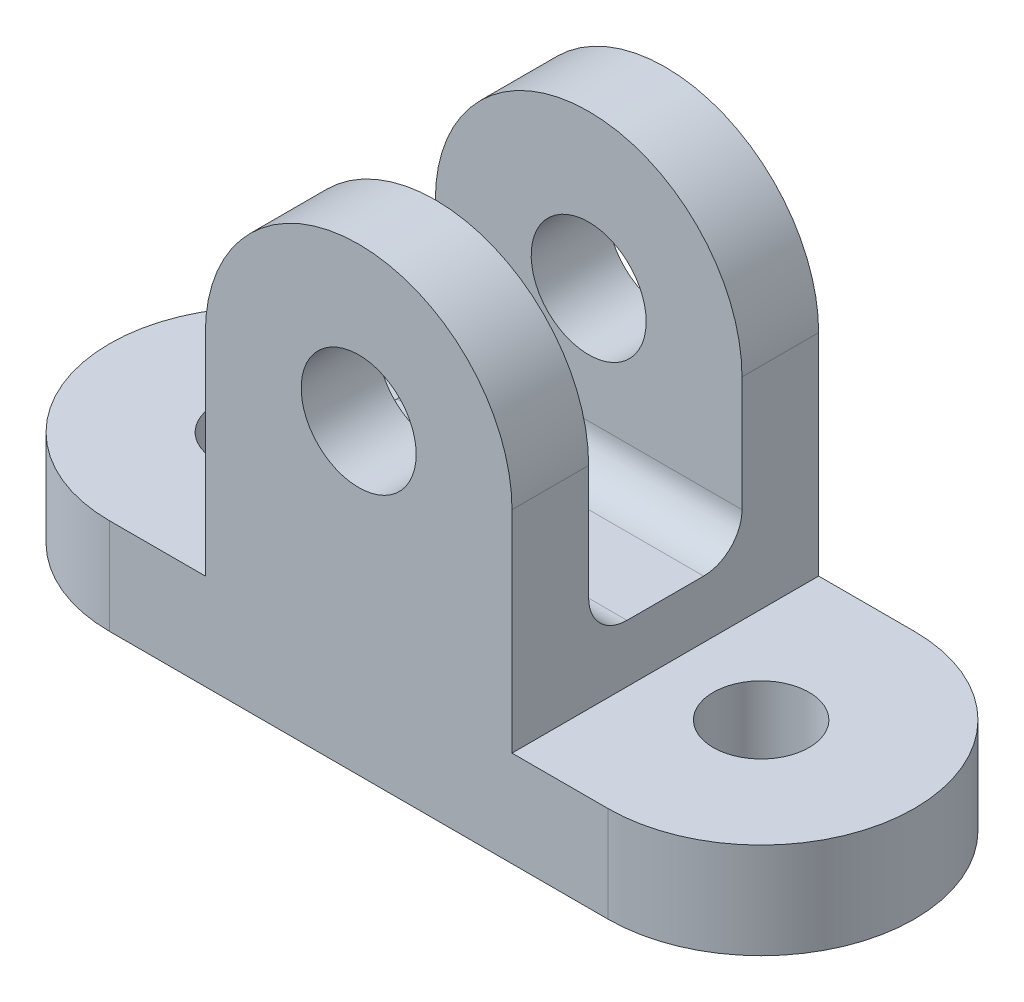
from build123d import *

# Parameters (mm, degrees)
SALIENTE_EXTRUIR1_DEPTH = 5
SALIENTE_EXTRUIR2_DEPTH = 16
CROQUIS3_W              = 8
CROQUIS3_H              = 16
CORTAR_EXTRUIR1_DEPTH   = 39.48376281
CROQUIS4_R              = 2.5
CORTAR_EXTRUIR2_DEPTH   = 30.427877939
CROQUIS5_R              = 3
CORTAR_EXTRUIR3_DEPTH   = 36.67912555
REDONDEO1_R             = 2


with BuildPart() as part:
    # Croquis1 → Saliente-Extruir1 (new body)
    with BuildSketch(Plane(origin=(0, 0, 0), x_dir=(1, 0, 0), z_dir=(0, 1, 0))):
        with BuildLine():
            Line((-13, 8), (13, 8))
            ThreePointArc((13, 8), (21, 0), (13, -8))
            Line((13, -8), (-13, -8))
            ThreePointArc((-13, -8), (-21, 0), (-13, 8))
        make_face()
    extrude(amount=SALIENTE_EXTRUIR1_DEPTH)

    # Croquis2 → Saliente-Extruir2 (add)
    with BuildSketch(Plane.XY.offset(8)):
        with BuildLine():
            Line((-8, 5), (-8, 16))
            ThreePointArc((-8, 16), (0, 24), (8, 16))
            Line((8, 16), (8, 5))
            Line((8, 5), (-8, 5))
        make_face()
    extrude(amount=-SALIENTE_EXTRUIR2_DEPTH)

    # Croquis3 → Cortar-Extruir1 (cut, through all)
    with BuildSketch(Plane(origin=(8, 0, 0), x_dir=(0, 0, -1), z_dir=(1, 0, 0))):
        with Locations((0, 16)):
            Rectangle(CROQUIS3_W, CROQUIS3_H)
    extrude(amount=-CORTAR_EXTRUIR1_DEPTH, mode=Mode.SUBTRACT)

    # Croquis4 → Cortar-Extruir2 (cut, through all)
    with BuildSketch(Plane(origin=(0, 5, 0), x_dir=(1, 0, 0), z_dir=(0, 1, 0))):
        with Locations(Location((-13, 0, 0), (0, 0, 270))):
            Circle(CROQUIS4_R)
        with Locations(Location((13, 0, 0), (0, 0, 270))):
            Circle(CROQUIS4_R)
    extrude(amount=-CORTAR_EXTRUIR2_DEPTH, mode=Mode.SUBTRACT)

    # Croquis5 → Cortar-Extruir3 (cut, through all)
    with BuildSketch(Plane.XY.offset(8)):
        with Locations((0, 16)):
            Circle(CROQUIS5_R)
    extrude(amount=-CORTAR_EXTRUIR3_DEPTH, mode=Mode.SUBTRACT)

    # Redondeo1
    redondeo1_edges = [part.edges().sort_by_distance(p)[0] for p in [
        (0, 8, 4),
        (0, 8, -4),
    ]]
    fillet(redondeo1_edges, radius=REDONDEO1_R)


solid = part.part
